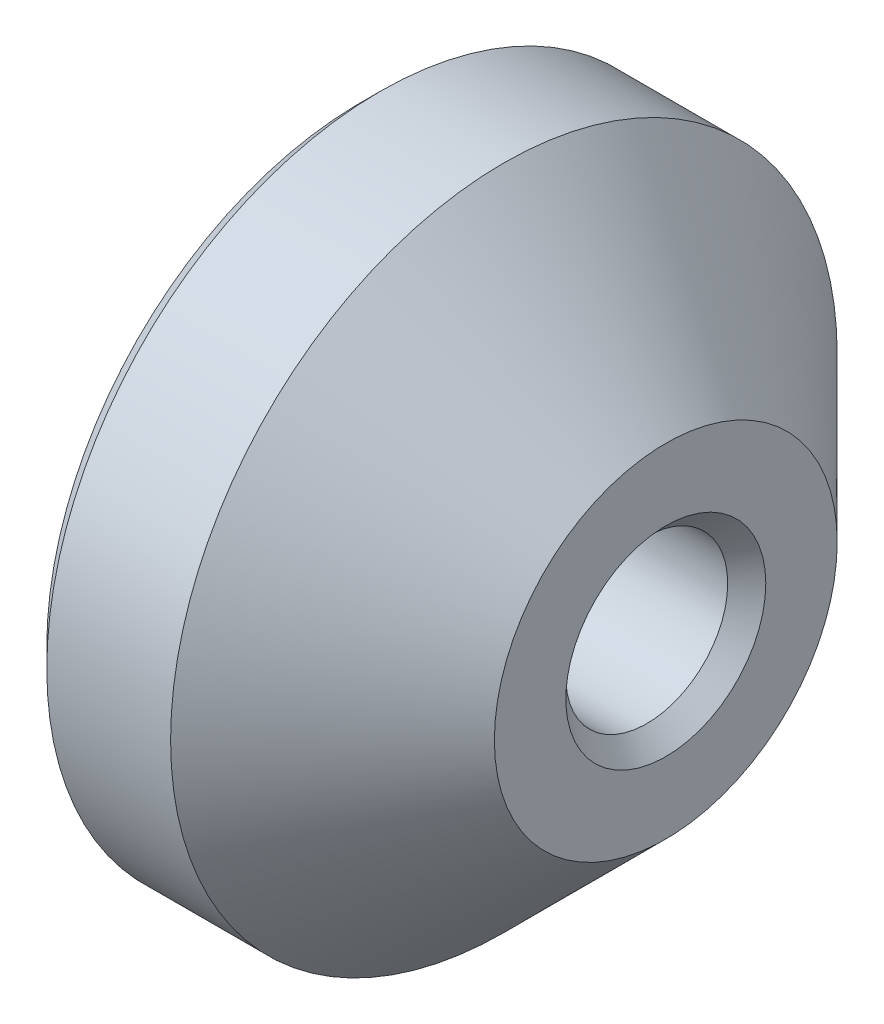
ISO-10303-21;
HEADER;
FILE_DESCRIPTION(('STEP AP214'),'2;1');
FILE_NAME('part.step','',(''),(''),'','','');
FILE_SCHEMA(('AUTOMOTIVE_DESIGN { 1 0 10303 214 1 1 1 1 }'));
ENDSEC;
DATA;
#1=APPLICATION_CONTEXT('core data for automotive mechanical design processes');
#2=APPLICATION_PROTOCOL_DEFINITION('international standard','automotive_design',2000,#1);
#3=PRODUCT_CONTEXT('',#1,'mechanical');
#4=PRODUCT('Part','Part','',(#3));
#5=PRODUCT_RELATED_PRODUCT_CATEGORY('part','',(#4));
#6=PRODUCT_DEFINITION_FORMATION('','',#4);
#7=PRODUCT_DEFINITION_CONTEXT('part definition',#1,'design');
#8=PRODUCT_DEFINITION('design','',#6,#7);
#9=PRODUCT_DEFINITION_SHAPE('','',#8);
#10=(LENGTH_UNIT() NAMED_UNIT(*) SI_UNIT(.MILLI.,.METRE.));
#11=(NAMED_UNIT(*) PLANE_ANGLE_UNIT() SI_UNIT($,.RADIAN.));
#12=(NAMED_UNIT(*) SI_UNIT($,.STERADIAN.) SOLID_ANGLE_UNIT());
#13=UNCERTAINTY_MEASURE_WITH_UNIT(LENGTH_MEASURE(1.E-05),#10,'distance_accuracy_value','');
#14=(GEOMETRIC_REPRESENTATION_CONTEXT(3) GLOBAL_UNCERTAINTY_ASSIGNED_CONTEXT((#13)) GLOBAL_UNIT_ASSIGNED_CONTEXT((#10,
#11,#12)) REPRESENTATION_CONTEXT('',''));
#15=CARTESIAN_POINT('',(0.,0.,0.));
#16=DIRECTION('',(0.,0.,1.));
#17=DIRECTION('',(1.,0.,0.));
#18=AXIS2_PLACEMENT_3D('',#15,#16,#17);
#19=CARTESIAN_POINT('',(0.,0.,0.));
#20=DIRECTION('',(1.,0.,0.));
#21=DIRECTION('',(0.,0.,-1.00000000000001));
#22=AXIS2_PLACEMENT_3D('',#19,#20,#21);
#23=PLANE('',#22);
#24=CARTESIAN_POINT('',(0.,0.,0.));
#25=DIRECTION('',(1.,0.,0.));
#26=DIRECTION('',(0.,0.,-1.00000000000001));
#27=AXIS2_PLACEMENT_3D('',#24,#25,#26);
#28=CIRCLE('',#27,5.24999999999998);
#29=CARTESIAN_POINT('',(0.,0.,-5.25000000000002));
#30=VERTEX_POINT('',#29);
#31=EDGE_CURVE('E10',#30,#30,#28,.F.);
#32=ORIENTED_EDGE('',*,*,#31,.T.);
#33=EDGE_LOOP('',(#32));
#34=FACE_BOUND('',#33,.T.);
#35=CARTESIAN_POINT('',(0.,0.,0.));
#36=DIRECTION('',(1.,0.,0.));
#37=DIRECTION('',(0.,0.,-1.00000000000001));
#38=AXIS2_PLACEMENT_3D('',#35,#36,#37);
#39=CIRCLE('',#38,9.);
#40=CARTESIAN_POINT('',(0.,0.,-9.00000000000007));
#41=VERTEX_POINT('',#40);
#42=EDGE_CURVE('E59',#41,#41,#39,.T.);
#43=ORIENTED_EDGE('',*,*,#42,.T.);
#44=EDGE_LOOP('',(#43));
#45=FACE_BOUND('',#44,.T.);
#46=ADVANCED_FACE('F34',(#34,#45),#23,.T.);
#47=CARTESIAN_POINT('',(0.,0.,0.));
#48=DIRECTION('',(-1.,0.,0.));
#49=DIRECTION('',(0.,0.,1.00000000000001));
#50=AXIS2_PLACEMENT_3D('',#47,#48,#49);
#51=CONICAL_SURFACE('',#50,9.,0.78539816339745);
#52=CARTESIAN_POINT('',(-8.49999999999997,0.,0.));
#53=DIRECTION('',(1.,0.,0.));
#54=DIRECTION('',(0.,0.,-1.00000000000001));
#55=AXIS2_PLACEMENT_3D('',#52,#53,#54);
#56=CIRCLE('',#55,17.5);
#57=CARTESIAN_POINT('',(-8.49999999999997,0.,-17.5000000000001));
#58=VERTEX_POINT('',#57);
#59=EDGE_CURVE('E62',#58,#58,#56,.T.);
#60=ORIENTED_EDGE('',*,*,#59,.T.);
#61=EDGE_LOOP('',(#60));
#62=FACE_BOUND('',#61,.T.);
#63=ORIENTED_EDGE('',*,*,#42,.F.);
#64=EDGE_LOOP('',(#63));
#65=FACE_BOUND('',#64,.T.);
#66=ADVANCED_FACE('F66',(#62,#65),#51,.T.);
#67=CARTESIAN_POINT('',(0.,0.,0.));
#68=DIRECTION('',(1.,0.,0.));
#69=DIRECTION('',(0.,0.,-1.00000000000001));
#70=AXIS2_PLACEMENT_3D('',#67,#68,#69);
#71=CYLINDRICAL_SURFACE('',#70,17.5);
#72=CARTESIAN_POINT('',(-15.,0.,0.));
#73=DIRECTION('',(-1.,0.,0.));
#74=DIRECTION('',(0.,0.,1.00000000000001));
#75=AXIS2_PLACEMENT_3D('',#72,#73,#74);
#76=CIRCLE('',#75,17.5);
#77=CARTESIAN_POINT('',(-15.,0.,17.5000000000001));
#78=VERTEX_POINT('',#77);
#79=EDGE_CURVE('E56',#78,#78,#76,.F.);
#80=ORIENTED_EDGE('',*,*,#79,.T.);
#81=EDGE_LOOP('',(#80));
#82=FACE_BOUND('',#81,.T.);
#83=ORIENTED_EDGE('',*,*,#59,.F.);
#84=EDGE_LOOP('',(#83));
#85=FACE_BOUND('',#84,.T.);
#86=ADVANCED_FACE('F69',(#82,#85),#71,.T.);
#87=CARTESIAN_POINT('',(-16.,17.5000000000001,0.));
#88=DIRECTION('',(-1.,0.,0.));
#89=DIRECTION('',(0.,0.,1.00000000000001));
#90=AXIS2_PLACEMENT_3D('',#87,#88,#89);
#91=PLANE('',#90);
#92=CARTESIAN_POINT('',(-16.,0.,0.));
#93=DIRECTION('',(-1.,0.,0.));
#94=DIRECTION('',(0.,0.,1.00000000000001));
#95=AXIS2_PLACEMENT_3D('',#92,#93,#94);
#96=CIRCLE('',#95,16.5);
#97=CARTESIAN_POINT('',(-16.,0.,16.5000000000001));
#98=VERTEX_POINT('',#97);
#99=EDGE_CURVE('E48',#98,#98,#96,.T.);
#100=ORIENTED_EDGE('',*,*,#99,.T.);
#101=EDGE_LOOP('',(#100));
#102=FACE_BOUND('',#101,.T.);
#103=CARTESIAN_POINT('',(-16.,0.,0.));
#104=DIRECTION('',(-1.,0.,0.));
#105=DIRECTION('',(0.,0.,1.00000000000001));
#106=AXIS2_PLACEMENT_3D('',#103,#104,#105);
#107=CIRCLE('',#106,5.24999999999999);
#108=CARTESIAN_POINT('',(-16.,0.,5.25000000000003));
#109=VERTEX_POINT('',#108);
#110=EDGE_CURVE('E53',#109,#109,#107,.F.);
#111=ORIENTED_EDGE('',*,*,#110,.T.);
#112=EDGE_LOOP('',(#111));
#113=FACE_BOUND('',#112,.T.);
#114=ADVANCED_FACE('F71',(#102,#113),#91,.T.);
#115=CARTESIAN_POINT('',(0.,0.,0.));
#116=DIRECTION('',(1.,0.,0.));
#117=DIRECTION('',(0.,0.,-1.00000000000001));
#118=AXIS2_PLACEMENT_3D('',#115,#116,#117);
#119=CYLINDRICAL_SURFACE('',#118,4.24999999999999);
#120=CARTESIAN_POINT('',(-15.,0.,0.));
#121=DIRECTION('',(-1.,0.,0.));
#122=DIRECTION('',(0.,0.,1.00000000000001));
#123=AXIS2_PLACEMENT_3D('',#120,#121,#122);
#124=CIRCLE('',#123,4.24999999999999);
#125=CARTESIAN_POINT('',(-15.,0.,4.25000000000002));
#126=VERTEX_POINT('',#125);
#127=EDGE_CURVE('E40',#126,#126,#124,.T.);
#128=ORIENTED_EDGE('',*,*,#127,.T.);
#129=EDGE_LOOP('',(#128));
#130=FACE_BOUND('',#129,.T.);
#131=CARTESIAN_POINT('',(-0.999999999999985,0.,0.));
#132=DIRECTION('',(1.,0.,0.));
#133=DIRECTION('',(0.,0.,-1.00000000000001));
#134=AXIS2_PLACEMENT_3D('',#131,#132,#133);
#135=CIRCLE('',#134,4.24999999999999);
#136=CARTESIAN_POINT('',(-0.999999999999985,0.,-4.25000000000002));
#137=VERTEX_POINT('',#136);
#138=EDGE_CURVE('E44',#137,#137,#135,.T.);
#139=ORIENTED_EDGE('',*,*,#138,.T.);
#140=EDGE_LOOP('',(#139));
#141=FACE_BOUND('',#140,.T.);
#142=ADVANCED_FACE('F78',(#130,#141),#119,.F.);
#143=CARTESIAN_POINT('',(-15.,0.,0.));
#144=DIRECTION('',(1.,0.,0.));
#145=DIRECTION('',(0.,0.,-1.00000000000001));
#146=AXIS2_PLACEMENT_3D('',#143,#144,#145);
#147=CONICAL_SURFACE('',#146,17.5,0.785398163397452);
#148=ORIENTED_EDGE('',*,*,#99,.F.);
#149=EDGE_LOOP('',(#148));
#150=FACE_BOUND('',#149,.T.);
#151=ORIENTED_EDGE('',*,*,#79,.F.);
#152=EDGE_LOOP('',(#151));
#153=FACE_BOUND('',#152,.T.);
#154=ADVANCED_FACE('F110',(#150,#153),#147,.T.);
#155=CARTESIAN_POINT('',(-16.,0.,0.));
#156=DIRECTION('',(-1.,0.,0.));
#157=DIRECTION('',(0.,0.,1.00000000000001));
#158=AXIS2_PLACEMENT_3D('',#155,#156,#157);
#159=CONICAL_SURFACE('',#158,5.24999999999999,0.785398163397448);
#160=ORIENTED_EDGE('',*,*,#127,.F.);
#161=EDGE_LOOP('',(#160));
#162=FACE_BOUND('',#161,.T.);
#163=ORIENTED_EDGE('',*,*,#110,.F.);
#164=EDGE_LOOP('',(#163));
#165=FACE_BOUND('',#164,.T.);
#166=ADVANCED_FACE('F118',(#162,#165),#159,.F.);
#167=CARTESIAN_POINT('',(-0.999999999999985,0.,0.));
#168=DIRECTION('',(1.,0.,0.));
#169=DIRECTION('',(0.,0.,-1.00000000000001));
#170=AXIS2_PLACEMENT_3D('',#167,#168,#169);
#171=CONICAL_SURFACE('',#170,4.24999999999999,0.785398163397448);
#172=ORIENTED_EDGE('',*,*,#31,.F.);
#173=EDGE_LOOP('',(#172));
#174=FACE_BOUND('',#173,.T.);
#175=ORIENTED_EDGE('',*,*,#138,.F.);
#176=EDGE_LOOP('',(#175));
#177=FACE_BOUND('',#176,.T.);
#178=ADVANCED_FACE('F128',(#174,#177),#171,.F.);
#179=CLOSED_SHELL('',(#46,#66,#86,#114,#142,#154,#166,#178));
#180=MANIFOLD_SOLID_BREP('B2',#179);
#181=ADVANCED_BREP_SHAPE_REPRESENTATION('',(#18,#180),#14);
#182=SHAPE_DEFINITION_REPRESENTATION(#9,#181);
ENDSEC;
END-ISO-10303-21;
